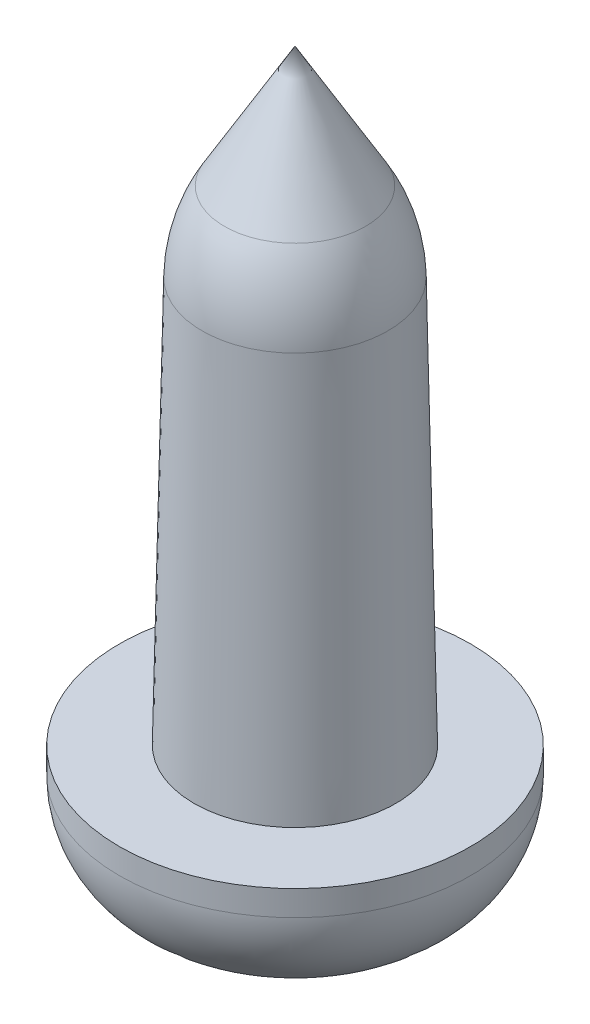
ISO-10303-21;
HEADER;
FILE_DESCRIPTION(('STEP AP214'),'2;1');
FILE_NAME('part.step','',(''),(''),'','','');
FILE_SCHEMA(('AUTOMOTIVE_DESIGN { 1 0 10303 214 1 1 1 1 }'));
ENDSEC;
DATA;
#1=APPLICATION_CONTEXT('core data for automotive mechanical design processes');
#2=APPLICATION_PROTOCOL_DEFINITION('international standard','automotive_design',2000,#1);
#3=PRODUCT_CONTEXT('',#1,'mechanical');
#4=PRODUCT('Part','Part','',(#3));
#5=PRODUCT_RELATED_PRODUCT_CATEGORY('part','',(#4));
#6=PRODUCT_DEFINITION_FORMATION('','',#4);
#7=PRODUCT_DEFINITION_CONTEXT('part definition',#1,'design');
#8=PRODUCT_DEFINITION('design','',#6,#7);
#9=PRODUCT_DEFINITION_SHAPE('','',#8);
#10=(LENGTH_UNIT() NAMED_UNIT(*) SI_UNIT(.MILLI.,.METRE.));
#11=(NAMED_UNIT(*) PLANE_ANGLE_UNIT() SI_UNIT($,.RADIAN.));
#12=(NAMED_UNIT(*) SI_UNIT($,.STERADIAN.) SOLID_ANGLE_UNIT());
#13=UNCERTAINTY_MEASURE_WITH_UNIT(LENGTH_MEASURE(1.E-05),#10,'distance_accuracy_value','');
#14=(GEOMETRIC_REPRESENTATION_CONTEXT(3) GLOBAL_UNCERTAINTY_ASSIGNED_CONTEXT((#13)) GLOBAL_UNIT_ASSIGNED_CONTEXT((#10,
#11,#12)) REPRESENTATION_CONTEXT('',''));
#15=CARTESIAN_POINT('',(0.,0.,0.));
#16=DIRECTION('',(0.,0.,1.));
#17=DIRECTION('',(1.,0.,0.));
#18=AXIS2_PLACEMENT_3D('',#15,#16,#17);
#19=CARTESIAN_POINT('',(0.,4.31540969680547E-06,0.));
#20=DIRECTION('',(0.,-1.,0.));
#21=DIRECTION('',(0.,0.,-1.));
#22=AXIS2_PLACEMENT_3D('',#19,#20,#21);
#23=PLANE('',#22);
#24=DIRECTION('',(-1.,0.,0.));
#25=VECTOR('',#24,1.);
#26=CARTESIAN_POINT('',(0.,4.31540969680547E-06,0.349999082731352));
#27=LINE('',#26,#25);
#28=CARTESIAN_POINT('',(0.652004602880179,1.16357725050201E-06,0.350000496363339));
#29=VERTEX_POINT('',#28);
#30=CARTESIAN_POINT('',(0.55,4.3154096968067E-06,0.349999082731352));
#31=VERTEX_POINT('',#30);
#32=EDGE_CURVE('E104',#29,#31,#27,.T.);
#33=ORIENTED_EDGE('',*,*,#32,.F.);
#34=CARTESIAN_POINT('',(0.,8.63081939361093E-06,0.));
#35=DIRECTION('',(0.,-1.,0.));
#36=DIRECTION('',(0.,0.,-1.));
#37=AXIS2_PLACEMENT_3D('',#34,#35,#36);
#38=CIRCLE('',#37,0.74001166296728);
#39=CARTESIAN_POINT('',(0.349998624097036,6.47311451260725E-06,0.652007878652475));
#40=VERTEX_POINT('',#39);
#41=EDGE_CURVE('E342',#29,#40,#38,.T.);
#42=ORIENTED_EDGE('',*,*,#41,.T.);
#43=DIRECTION('',(0.,0.,1.));
#44=VECTOR('',#43,1.);
#45=CARTESIAN_POINT('',(0.349999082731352,4.31540969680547E-06,0.));
#46=LINE('',#45,#44);
#47=CARTESIAN_POINT('',(0.349999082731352,4.3154096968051E-06,0.55));
#48=VERTEX_POINT('',#47);
#49=EDGE_CURVE('E124',#48,#40,#46,.T.);
#50=ORIENTED_EDGE('',*,*,#49,.F.);
#51=CARTESIAN_POINT('',(0.55,4.31540969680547E-06,0.55));
#52=DIRECTION('',(0.,-1.,0.));
#53=DIRECTION('',(0.,0.,-1.));
#54=AXIS2_PLACEMENT_3D('',#51,#52,#53);
#55=CIRCLE('',#54,0.200000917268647);
#56=EDGE_CURVE('E116',#31,#48,#55,.F.);
#57=ORIENTED_EDGE('',*,*,#56,.F.);
#58=EDGE_LOOP('',(#33,#42,#50,#57));
#59=FACE_BOUND('',#58,.T.);
#60=ADVANCED_FACE('F33',(#59),#23,.T.);
#61=DIRECTION('',(0.,0.,-1.));
#62=VECTOR('',#61,1.);
#63=CARTESIAN_POINT('',(-0.349999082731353,4.31540969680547E-06,0.));
#64=LINE('',#63,#62);
#65=CARTESIAN_POINT('',(-0.35000049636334,1.1635772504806E-06,0.652004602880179));
#66=VERTEX_POINT('',#65);
#67=CARTESIAN_POINT('',(-0.349999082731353,4.31540969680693E-06,0.55));
#68=VERTEX_POINT('',#67);
#69=EDGE_CURVE('E126',#66,#68,#64,.T.);
#70=ORIENTED_EDGE('',*,*,#69,.F.);
#71=CARTESIAN_POINT('',(-0.652007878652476,6.47311451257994E-06,0.349998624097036));
#72=VERTEX_POINT('',#71);
#73=EDGE_CURVE('E345',#66,#72,#38,.T.);
#74=ORIENTED_EDGE('',*,*,#73,.T.);
#75=DIRECTION('',(-1.,0.,0.));
#76=VECTOR('',#75,1.);
#77=CARTESIAN_POINT('',(0.,4.31540969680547E-06,0.349999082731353));
#78=LINE('',#77,#76);
#79=CARTESIAN_POINT('',(-0.55,4.31540969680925E-06,0.349999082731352));
#80=VERTEX_POINT('',#79);
#81=EDGE_CURVE('E135',#80,#72,#78,.T.);
#82=ORIENTED_EDGE('',*,*,#81,.F.);
#83=CARTESIAN_POINT('',(-0.55,4.31540969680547E-06,0.55));
#84=DIRECTION('',(0.,-1.,0.));
#85=DIRECTION('',(0.,0.,-1.));
#86=AXIS2_PLACEMENT_3D('',#83,#84,#85);
#87=CIRCLE('',#86,0.200000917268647);
#88=EDGE_CURVE('E132',#68,#80,#87,.F.);
#89=ORIENTED_EDGE('',*,*,#88,.F.);
#90=EDGE_LOOP('',(#70,#74,#82,#89));
#91=FACE_BOUND('',#90,.T.);
#92=ADVANCED_FACE('F313',(#91),#23,.T.);
#93=DIRECTION('',(1.,0.,0.));
#94=VECTOR('',#93,1.);
#95=CARTESIAN_POINT('',(0.,4.31540969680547E-06,-0.349999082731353));
#96=LINE('',#95,#94);
#97=CARTESIAN_POINT('',(-0.652004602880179,1.16357725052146E-06,-0.350000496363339));
#98=VERTEX_POINT('',#97);
#99=CARTESIAN_POINT('',(-0.55,4.31540969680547E-06,-0.349999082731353));
#100=VERTEX_POINT('',#99);
#101=EDGE_CURVE('E137',#98,#100,#96,.T.);
#102=ORIENTED_EDGE('',*,*,#101,.F.);
#103=CARTESIAN_POINT('',(-0.349998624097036,6.47311451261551E-06,-0.652007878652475));
#104=VERTEX_POINT('',#103);
#105=EDGE_CURVE('E358',#98,#104,#38,.T.);
#106=ORIENTED_EDGE('',*,*,#105,.T.);
#107=DIRECTION('',(0.,0.,-1.));
#108=VECTOR('',#107,1.);
#109=CARTESIAN_POINT('',(-0.349999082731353,4.31540969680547E-06,0.));
#110=LINE('',#109,#108);
#111=CARTESIAN_POINT('',(-0.349999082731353,4.3154096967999E-06,-0.55));
#112=VERTEX_POINT('',#111);
#113=EDGE_CURVE('E144',#112,#104,#110,.T.);
#114=ORIENTED_EDGE('',*,*,#113,.F.);
#115=CARTESIAN_POINT('',(-0.55,4.31540969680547E-06,-0.55));
#116=DIRECTION('',(0.,-1.,0.));
#117=DIRECTION('',(0.,0.,-1.));
#118=AXIS2_PLACEMENT_3D('',#115,#116,#117);
#119=CIRCLE('',#118,0.200000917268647);
#120=EDGE_CURVE('E141',#100,#112,#119,.F.);
#121=ORIENTED_EDGE('',*,*,#120,.F.);
#122=EDGE_LOOP('',(#102,#106,#114,#121));
#123=FACE_BOUND('',#122,.T.);
#124=ADVANCED_FACE('F317',(#123),#23,.T.);
#125=DIRECTION('',(0.,0.,1.));
#126=VECTOR('',#125,1.);
#127=CARTESIAN_POINT('',(0.349999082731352,4.31540969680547E-06,0.));
#128=LINE('',#127,#126);
#129=CARTESIAN_POINT('',(0.350000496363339,1.16357725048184E-06,-0.652004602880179));
#130=VERTEX_POINT('',#129);
#131=CARTESIAN_POINT('',(0.349999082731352,4.31540969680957E-06,-0.55));
#132=VERTEX_POINT('',#131);
#133=EDGE_CURVE('E146',#130,#132,#128,.T.);
#134=ORIENTED_EDGE('',*,*,#133,.F.);
#135=CARTESIAN_POINT('',(0.652007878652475,6.47311451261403E-06,-0.349998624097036));
#136=VERTEX_POINT('',#135);
#137=EDGE_CURVE('E333',#130,#136,#38,.T.);
#138=ORIENTED_EDGE('',*,*,#137,.T.);
#139=DIRECTION('',(1.,0.,0.));
#140=VECTOR('',#139,1.);
#141=CARTESIAN_POINT('',(0.,4.31540969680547E-06,-0.349999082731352));
#142=LINE('',#141,#140);
#143=CARTESIAN_POINT('',(0.55,4.31540969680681E-06,-0.349999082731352));
#144=VERTEX_POINT('',#143);
#145=EDGE_CURVE('E153',#144,#136,#142,.T.);
#146=ORIENTED_EDGE('',*,*,#145,.F.);
#147=CARTESIAN_POINT('',(0.55,4.31540969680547E-06,-0.55));
#148=DIRECTION('',(0.,-1.,0.));
#149=DIRECTION('',(0.,0.,-1.));
#150=AXIS2_PLACEMENT_3D('',#147,#148,#149);
#151=CIRCLE('',#150,0.200000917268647);
#152=EDGE_CURVE('E150',#132,#144,#151,.F.);
#153=ORIENTED_EDGE('',*,*,#152,.F.);
#154=EDGE_LOOP('',(#134,#138,#146,#153));
#155=FACE_BOUND('',#154,.T.);
#156=ADVANCED_FACE('F35',(#155),#23,.T.);
#157=CARTESIAN_POINT('',(0.,1.00000863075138,0.));
#158=DIRECTION('',(0.,-1.,0.));
#159=DIRECTION('',(0.,0.,-1.));
#160=AXIS2_PLACEMENT_3D('',#157,#158,#159);
#161=DEGENERATE_TOROIDAL_SURFACE('',#160,0.739999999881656,1.,.T.);
#162=CARTESIAN_POINT('',(0.26933841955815,0.379482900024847,-1.50020000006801));
#163=CARTESIAN_POINT('',(0.274102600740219,0.357069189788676,-1.48132507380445));
#164=CARTESIAN_POINT('',(0.278695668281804,0.335460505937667,-1.46147507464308));
#165=CARTESIAN_POINT('',(0.287512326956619,0.293981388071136,-1.41996635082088));
#166=CARTESIAN_POINT('',(0.291735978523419,0.274110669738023,-1.39830792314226));
#167=CARTESIAN_POINT('',(0.30376985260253,0.217495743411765,-1.33107012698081));
#168=CARTESIAN_POINT('',(0.310996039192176,0.183499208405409,-1.28301716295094));
#169=CARTESIAN_POINT('',(0.323683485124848,0.123809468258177,-1.18182195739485));
#170=CARTESIAN_POINT('',(0.3291441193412,0.0981192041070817,-1.12867792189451));
#171=CARTESIAN_POINT('',(0.338198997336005,0.0555193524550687,-1.01870742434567));
#172=CARTESIAN_POINT('',(0.341790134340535,0.0386243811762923,-0.961875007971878));
#173=CARTESIAN_POINT('',(0.345749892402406,0.0199951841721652,-0.875059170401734));
#174=CARTESIAN_POINT('',(0.346832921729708,0.0148999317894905,-0.845781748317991));
#175=CARTESIAN_POINT('',(0.348526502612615,0.0069322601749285,-0.786899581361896));
#176=CARTESIAN_POINT('',(0.349136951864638,0.00406032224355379,-0.757294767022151));
#177=CARTESIAN_POINT('',(0.349897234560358,0.000483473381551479,-0.698008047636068));
#178=CARTESIAN_POINT('',(0.35004789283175,-0.000225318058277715,-0.668326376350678));
#179=CARTESIAN_POINT('',(0.349919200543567,0.000380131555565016,-0.609001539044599));
#180=CARTESIAN_POINT('',(0.349640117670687,0.00169311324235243,-0.579358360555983));
#181=CARTESIAN_POINT('',(0.34916036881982,0.00395015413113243,-0.549799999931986));
#182=B_SPLINE_CURVE_WITH_KNOTS('',3,(#162,#163,#164,#165,#166,#167,#168,#169,#170,#171,#172,
#173,#174,#175,#176,#177,#178,#179,#180,#181),.UNSPECIFIED.,.F.,.F.,(4,2,2,2,2,2,2,2,2,4),(0.,
0.0890046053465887,0.177994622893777,0.354994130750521,0.532056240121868,0.709411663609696,
0.798550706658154,0.887709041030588,0.976707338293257,1.06565022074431),.UNSPECIFIED.);
#183=CARTESIAN_POINT('',(0.284428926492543,0.308487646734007,-1.43442892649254));
#184=VERTEX_POINT('',#183);
#185=EDGE_CURVE('E11',#184,#130,#182,.T.);
#186=ORIENTED_EDGE('',*,*,#185,.F.);
#187=CARTESIAN_POINT('',(-0.350200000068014,0.320863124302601,-1.43179843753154));
#188=CARTESIAN_POINT('',(-0.303864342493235,0.311157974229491,-1.43386133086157));
#189=CARTESIAN_POINT('',(-0.257100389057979,0.303497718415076,-1.43548956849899));
#190=CARTESIAN_POINT('',(-0.163042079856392,0.292112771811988,-1.43790951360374));
#191=CARTESIAN_POINT('',(-0.115747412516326,0.288390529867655,-1.43870070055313));
#192=CARTESIAN_POINT('',(-0.0212573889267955,0.284748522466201,-1.43947483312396));
#193=CARTESIAN_POINT('',(0.0259372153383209,0.284809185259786,-1.43946193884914));
#194=CARTESIAN_POINT('',(0.120143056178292,0.288692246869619,-1.4386365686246));
#195=CARTESIAN_POINT('',(0.16715439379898,0.292512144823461,-1.4378246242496));
#196=CARTESIAN_POINT('',(0.236724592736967,0.301085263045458,-1.43600235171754));
#197=CARTESIAN_POINT('',(0.259481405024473,0.304359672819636,-1.43530635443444));
#198=CARTESIAN_POINT('',(0.304927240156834,0.311876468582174,-1.43370861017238));
#199=CARTESIAN_POINT('',(0.327615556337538,0.316122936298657,-1.43280599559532));
#200=CARTESIAN_POINT('',(0.350200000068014,0.3208631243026,-1.43179843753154));
#201=B_SPLINE_CURVE_WITH_KNOTS('',3,(#187,#188,#189,#190,#191,#192,#193,#194,#195,#196,#197,
#198,#199,#200),.UNSPECIFIED.,.F.,.F.,(4,2,2,2,2,2,4),(0.,0.14208299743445,0.284254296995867,
0.425690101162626,0.567031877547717,0.63601873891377,0.705300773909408),.UNSPECIFIED.);
#202=CARTESIAN_POINT('',(-0.284428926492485,0.308487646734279,-1.43442892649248));
#203=VERTEX_POINT('',#202);
#204=EDGE_CURVE('E43',#203,#184,#201,.T.);
#205=ORIENTED_EDGE('',*,*,#204,.F.);
#206=CARTESIAN_POINT('',(-0.34916036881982,0.00395015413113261,-0.549799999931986));
#207=CARTESIAN_POINT('',(-0.349716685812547,0.00133288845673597,-0.583987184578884));
#208=CARTESIAN_POINT('',(-0.350002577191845,-1.2124734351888E-05,-0.618292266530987));
#209=CARTESIAN_POINT('',(-0.349993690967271,2.9681665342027E-05,-0.686928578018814));
#210=CARTESIAN_POINT('',(-0.349698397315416,0.00141892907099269,-0.721259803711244));
#211=CARTESIAN_POINT('',(-0.348484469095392,0.00713001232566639,-0.789774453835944));
#212=CARTESIAN_POINT('',(-0.34756406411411,0.011460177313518,-0.823957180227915));
#213=CARTESIAN_POINT('',(-0.345083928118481,0.023128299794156,-0.891760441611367));
#214=CARTESIAN_POINT('',(-0.343524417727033,0.0304652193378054,-0.925381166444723));
#215=CARTESIAN_POINT('',(-0.337924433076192,0.0568110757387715,-1.02411488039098));
#216=CARTESIAN_POINT('',(-0.332946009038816,0.0802327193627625,-1.08806501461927));
#217=CARTESIAN_POINT('',(-0.320576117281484,0.138428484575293,-1.21009001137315));
#218=CARTESIAN_POINT('',(-0.313192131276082,0.173167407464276,-1.26818236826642));
#219=CARTESIAN_POINT('',(-0.29958334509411,0.237191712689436,-1.35514117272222));
#220=CARTESIAN_POINT('',(-0.294041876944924,0.263262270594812,-1.38652660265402));
#221=CARTESIAN_POINT('',(-0.282223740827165,0.318862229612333,-1.44597253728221));
#222=CARTESIAN_POINT('',(-0.275946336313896,0.348395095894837,-1.47402965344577));
#223=CARTESIAN_POINT('',(-0.26933841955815,0.379482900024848,-1.50020000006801));
#224=B_SPLINE_CURVE_WITH_KNOTS('',3,(#206,#207,#208,#209,#210,#211,#212,#213,#214,#215,#216,
#217,#218,#219,#220,#221,#222,#223),.UNSPECIFIED.,.F.,.F.,(4,2,2,2,2,2,2,2,4),(0.,
0.10287413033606,0.205839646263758,0.309097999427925,0.412320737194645,0.615903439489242,
0.818858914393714,0.942120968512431,1.06550745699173),.UNSPECIFIED.);
#225=EDGE_CURVE('E294',#104,#203,#224,.T.);
#226=ORIENTED_EDGE('',*,*,#225,.F.);
#227=ORIENTED_EDGE('',*,*,#105,.F.);
#228=CARTESIAN_POINT('',(-1.50020000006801,0.379482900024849,-0.269338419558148));
#229=CARTESIAN_POINT('',(-1.48132507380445,0.357069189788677,-0.274102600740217));
#230=CARTESIAN_POINT('',(-1.46147507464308,0.335460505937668,-0.278695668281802));
#231=CARTESIAN_POINT('',(-1.41996635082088,0.293981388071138,-0.287512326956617));
#232=CARTESIAN_POINT('',(-1.39830792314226,0.274110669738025,-0.291735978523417));
#233=CARTESIAN_POINT('',(-1.33107012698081,0.217495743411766,-0.303769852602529));
#234=CARTESIAN_POINT('',(-1.28301716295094,0.18349920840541,-0.310996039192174));
#235=CARTESIAN_POINT('',(-1.18182195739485,0.123809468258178,-0.323683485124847));
#236=CARTESIAN_POINT('',(-1.12867792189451,0.0981192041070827,-0.329144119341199));
#237=CARTESIAN_POINT('',(-1.01870742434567,0.0555193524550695,-0.338198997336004));
#238=CARTESIAN_POINT('',(-0.96187500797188,0.0386243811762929,-0.341790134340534));
#239=CARTESIAN_POINT('',(-0.875059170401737,0.0199951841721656,-0.345749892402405));
#240=CARTESIAN_POINT('',(-0.845781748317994,0.0148999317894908,-0.346832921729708));
#241=CARTESIAN_POINT('',(-0.786899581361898,0.00693226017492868,-0.348526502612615));
#242=CARTESIAN_POINT('',(-0.757294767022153,0.00406032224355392,-0.349136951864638));
#243=CARTESIAN_POINT('',(-0.698008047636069,0.000483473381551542,-0.349897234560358));
#244=CARTESIAN_POINT('',(-0.66832637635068,-0.000225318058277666,-0.350047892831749));
#245=CARTESIAN_POINT('',(-0.6090015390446,0.000380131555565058,-0.349919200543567));
#246=CARTESIAN_POINT('',(-0.579358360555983,0.00169311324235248,-0.349640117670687));
#247=CARTESIAN_POINT('',(-0.549799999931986,0.00395015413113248,-0.34916036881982));
#248=B_SPLINE_CURVE_WITH_KNOTS('',3,(#228,#229,#230,#231,#232,#233,#234,#235,#236,#237,#238,
#239,#240,#241,#242,#243,#244,#245,#246,#247),.UNSPECIFIED.,.F.,.F.,(4,2,2,2,2,2,2,2,2,4),(0.,
0.0890046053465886,0.177994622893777,0.354994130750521,0.532056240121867,0.709411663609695,
0.798550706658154,0.887709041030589,0.976707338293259,1.06565022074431),.UNSPECIFIED.);
#249=CARTESIAN_POINT('',(-1.43442892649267,0.308487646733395,-0.284428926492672));
#250=VERTEX_POINT('',#249);
#251=EDGE_CURVE('E293',#250,#98,#248,.T.);
#252=ORIENTED_EDGE('',*,*,#251,.F.);
#253=CARTESIAN_POINT('',(-1.43179843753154,0.320863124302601,0.350200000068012));
#254=CARTESIAN_POINT('',(-1.43386133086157,0.311157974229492,0.303864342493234));
#255=CARTESIAN_POINT('',(-1.435489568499,0.303497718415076,0.257100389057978));
#256=CARTESIAN_POINT('',(-1.43790951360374,0.292112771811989,0.163042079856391));
#257=CARTESIAN_POINT('',(-1.43870070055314,0.288390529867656,0.115747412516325));
#258=CARTESIAN_POINT('',(-1.43947483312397,0.284748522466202,0.021257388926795));
#259=CARTESIAN_POINT('',(-1.43946193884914,0.284809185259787,-0.0259372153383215));
#260=CARTESIAN_POINT('',(-1.4386365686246,0.28869224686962,-0.120143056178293));
#261=CARTESIAN_POINT('',(-1.4378246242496,0.292512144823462,-0.16715439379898));
#262=CARTESIAN_POINT('',(-1.43600235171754,0.301085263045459,-0.236724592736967));
#263=CARTESIAN_POINT('',(-1.43530635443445,0.304359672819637,-0.259481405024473));
#264=CARTESIAN_POINT('',(-1.43370861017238,0.311876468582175,-0.304927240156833));
#265=CARTESIAN_POINT('',(-1.43280599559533,0.316122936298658,-0.327615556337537));
#266=CARTESIAN_POINT('',(-1.43179843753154,0.320863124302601,-0.350200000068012));
#267=B_SPLINE_CURVE_WITH_KNOTS('',3,(#253,#254,#255,#256,#257,#258,#259,#260,#261,#262,#263,
#264,#265,#266),.UNSPECIFIED.,.F.,.F.,(4,2,2,2,2,2,4),(0.,0.142082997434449,0.284254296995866,
0.425690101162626,0.567031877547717,0.636018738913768,0.705300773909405),.UNSPECIFIED.);
#268=CARTESIAN_POINT('',(-1.43442892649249,0.308487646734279,0.284428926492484));
#269=VERTEX_POINT('',#268);
#270=EDGE_CURVE('E266',#269,#250,#267,.T.);
#271=ORIENTED_EDGE('',*,*,#270,.F.);
#272=CARTESIAN_POINT('',(-0.549799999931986,0.00395015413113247,0.34916036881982));
#273=CARTESIAN_POINT('',(-0.583987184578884,0.0013328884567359,0.349716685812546));
#274=CARTESIAN_POINT('',(-0.618292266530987,-1.21247343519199E-05,0.350002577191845));
#275=CARTESIAN_POINT('',(-0.686928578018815,2.96816653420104E-05,0.34999369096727));
#276=CARTESIAN_POINT('',(-0.721259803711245,0.00141892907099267,0.349698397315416));
#277=CARTESIAN_POINT('',(-0.789774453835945,0.00713001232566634,0.348484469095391));
#278=CARTESIAN_POINT('',(-0.823957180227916,0.0114601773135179,0.347564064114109));
#279=CARTESIAN_POINT('',(-0.891760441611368,0.0231282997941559,0.34508392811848));
#280=CARTESIAN_POINT('',(-0.925381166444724,0.0304652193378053,0.343524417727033));
#281=CARTESIAN_POINT('',(-1.02411488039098,0.0568110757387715,0.337924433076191));
#282=CARTESIAN_POINT('',(-1.08806501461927,0.0802327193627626,0.332946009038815));
#283=CARTESIAN_POINT('',(-1.21009001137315,0.138428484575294,0.320576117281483));
#284=CARTESIAN_POINT('',(-1.26818236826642,0.173167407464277,0.313192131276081));
#285=CARTESIAN_POINT('',(-1.35514117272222,0.237191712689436,0.299583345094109));
#286=CARTESIAN_POINT('',(-1.38652660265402,0.263262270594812,0.294041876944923));
#287=CARTESIAN_POINT('',(-1.44597253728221,0.318862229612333,0.282223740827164));
#288=CARTESIAN_POINT('',(-1.47402965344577,0.348395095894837,0.275946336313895));
#289=CARTESIAN_POINT('',(-1.50020000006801,0.379482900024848,0.269338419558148));
#290=B_SPLINE_CURVE_WITH_KNOTS('',3,(#272,#273,#274,#275,#276,#277,#278,#279,#280,#281,#282,
#283,#284,#285,#286,#287,#288,#289),.UNSPECIFIED.,.F.,.F.,(4,2,2,2,2,2,2,2,4),(0.,
0.10287413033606,0.205839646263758,0.309097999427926,0.412320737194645,0.615903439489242,
0.818858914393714,0.942120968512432,1.06550745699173),.UNSPECIFIED.);
#291=EDGE_CURVE('E260',#72,#269,#290,.T.);
#292=ORIENTED_EDGE('',*,*,#291,.F.);
#293=ORIENTED_EDGE('',*,*,#73,.F.);
#294=CARTESIAN_POINT('',(-0.26933841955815,0.379482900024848,1.50020000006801));
#295=CARTESIAN_POINT('',(-0.274102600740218,0.357069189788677,1.48132507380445));
#296=CARTESIAN_POINT('',(-0.278695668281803,0.335460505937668,1.46147507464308));
#297=CARTESIAN_POINT('',(-0.287512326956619,0.293981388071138,1.41996635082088));
#298=CARTESIAN_POINT('',(-0.291735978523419,0.274110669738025,1.39830792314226));
#299=CARTESIAN_POINT('',(-0.30376985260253,0.217495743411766,1.33107012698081));
#300=CARTESIAN_POINT('',(-0.310996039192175,0.18349920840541,1.28301716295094));
#301=CARTESIAN_POINT('',(-0.323683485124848,0.123809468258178,1.18182195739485));
#302=CARTESIAN_POINT('',(-0.3291441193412,0.0981192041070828,1.12867792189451));
#303=CARTESIAN_POINT('',(-0.338198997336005,0.0555193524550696,1.01870742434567));
#304=CARTESIAN_POINT('',(-0.341790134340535,0.0386243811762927,0.96187500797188));
#305=CARTESIAN_POINT('',(-0.345749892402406,0.0199951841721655,0.875059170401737));
#306=CARTESIAN_POINT('',(-0.346832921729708,0.0148999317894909,0.845781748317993));
#307=CARTESIAN_POINT('',(-0.348526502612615,0.00693226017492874,0.786899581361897));
#308=CARTESIAN_POINT('',(-0.349136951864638,0.00406032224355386,0.757294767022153));
#309=CARTESIAN_POINT('',(-0.349897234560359,0.000483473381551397,0.698008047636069));
#310=CARTESIAN_POINT('',(-0.35004789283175,-0.000225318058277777,0.668326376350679));
#311=CARTESIAN_POINT('',(-0.349919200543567,0.000380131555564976,0.6090015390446));
#312=CARTESIAN_POINT('',(-0.349640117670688,0.00169311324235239,0.579358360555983));
#313=CARTESIAN_POINT('',(-0.34916036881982,0.00395015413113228,0.549799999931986));
#314=B_SPLINE_CURVE_WITH_KNOTS('',3,(#294,#295,#296,#297,#298,#299,#300,#301,#302,#303,#304,
#305,#306,#307,#308,#309,#310,#311,#312,#313),.UNSPECIFIED.,.F.,.F.,(4,2,2,2,2,2,2,2,2,4),(0.,
0.0890046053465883,0.177994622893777,0.354994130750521,0.532056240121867,0.709411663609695,
0.798550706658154,0.887709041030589,0.976707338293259,1.06565022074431),.UNSPECIFIED.);
#315=CARTESIAN_POINT('',(-0.284428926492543,0.308487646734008,1.43442892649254));
#316=VERTEX_POINT('',#315);
#317=EDGE_CURVE('E259',#316,#66,#314,.T.);
#318=ORIENTED_EDGE('',*,*,#317,.F.);
#319=CARTESIAN_POINT('',(0.350200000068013,0.3208631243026,1.43179843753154));
#320=CARTESIAN_POINT('',(0.303864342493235,0.311157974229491,1.43386133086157));
#321=CARTESIAN_POINT('',(0.257100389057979,0.303497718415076,1.43548956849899));
#322=CARTESIAN_POINT('',(0.163042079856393,0.292112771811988,1.43790951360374));
#323=CARTESIAN_POINT('',(0.115747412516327,0.288390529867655,1.43870070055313));
#324=CARTESIAN_POINT('',(0.0212573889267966,0.284748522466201,1.43947483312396));
#325=CARTESIAN_POINT('',(-0.0259372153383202,0.284809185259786,1.43946193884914));
#326=CARTESIAN_POINT('',(-0.120143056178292,0.288692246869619,1.4386365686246));
#327=CARTESIAN_POINT('',(-0.16715439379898,0.292512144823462,1.4378246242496));
#328=CARTESIAN_POINT('',(-0.236724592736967,0.301085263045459,1.43600235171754));
#329=CARTESIAN_POINT('',(-0.259481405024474,0.304359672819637,1.43530635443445));
#330=CARTESIAN_POINT('',(-0.304927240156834,0.311876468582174,1.43370861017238));
#331=CARTESIAN_POINT('',(-0.327615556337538,0.316122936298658,1.43280599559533));
#332=CARTESIAN_POINT('',(-0.350200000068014,0.320863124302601,1.43179843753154));
#333=B_SPLINE_CURVE_WITH_KNOTS('',3,(#319,#320,#321,#322,#323,#324,#325,#326,#327,#328,#329,
#330,#331,#332),.UNSPECIFIED.,.F.,.F.,(4,2,2,2,2,2,4),(0.,0.142082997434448,0.284254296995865,
0.425690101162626,0.567031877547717,0.636018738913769,0.705300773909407),.UNSPECIFIED.);
#334=CARTESIAN_POINT('',(0.284428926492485,0.308487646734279,1.43442892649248));
#335=VERTEX_POINT('',#334);
#336=EDGE_CURVE('E230',#335,#316,#333,.T.);
#337=ORIENTED_EDGE('',*,*,#336,.F.);
#338=CARTESIAN_POINT('',(0.349160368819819,0.00395015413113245,0.549799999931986));
#339=CARTESIAN_POINT('',(0.349716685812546,0.00133288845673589,0.583987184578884));
#340=CARTESIAN_POINT('',(0.350002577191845,-1.21247343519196E-05,0.618292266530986));
#341=CARTESIAN_POINT('',(0.34999369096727,2.96816653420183E-05,0.686928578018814));
#342=CARTESIAN_POINT('',(0.349698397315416,0.00141892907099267,0.721259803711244));
#343=CARTESIAN_POINT('',(0.348484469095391,0.00713001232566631,0.789774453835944));
#344=CARTESIAN_POINT('',(0.347564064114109,0.0114601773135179,0.823957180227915));
#345=CARTESIAN_POINT('',(0.34508392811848,0.0231282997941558,0.891760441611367));
#346=CARTESIAN_POINT('',(0.343524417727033,0.0304652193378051,0.925381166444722));
#347=CARTESIAN_POINT('',(0.337924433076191,0.0568110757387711,1.02411488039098));
#348=CARTESIAN_POINT('',(0.332946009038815,0.080232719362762,1.08806501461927));
#349=CARTESIAN_POINT('',(0.320576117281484,0.138428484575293,1.21009001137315));
#350=CARTESIAN_POINT('',(0.313192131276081,0.173167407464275,1.26818236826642));
#351=CARTESIAN_POINT('',(0.299583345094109,0.237191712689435,1.35514117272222));
#352=CARTESIAN_POINT('',(0.294041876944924,0.263262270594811,1.38652660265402));
#353=CARTESIAN_POINT('',(0.282223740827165,0.318862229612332,1.44597253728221));
#354=CARTESIAN_POINT('',(0.275946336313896,0.348395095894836,1.47402965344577));
#355=CARTESIAN_POINT('',(0.269338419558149,0.379482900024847,1.50020000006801));
#356=B_SPLINE_CURVE_WITH_KNOTS('',3,(#338,#339,#340,#341,#342,#343,#344,#345,#346,#347,#348,
#349,#350,#351,#352,#353,#354,#355),.UNSPECIFIED.,.F.,.F.,(4,2,2,2,2,2,2,2,4),(0.,
0.10287413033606,0.205839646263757,0.309097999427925,0.412320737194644,0.615903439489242,
0.818858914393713,0.94212096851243,1.06550745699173),.UNSPECIFIED.);
#357=EDGE_CURVE('E217',#40,#335,#356,.T.);
#358=ORIENTED_EDGE('',*,*,#357,.F.);
#359=ORIENTED_EDGE('',*,*,#41,.F.);
#360=CARTESIAN_POINT('',(1.50020000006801,0.379482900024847,0.26933841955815));
#361=CARTESIAN_POINT('',(1.48132507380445,0.357069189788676,0.274102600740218));
#362=CARTESIAN_POINT('',(1.46147507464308,0.335460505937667,0.278695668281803));
#363=CARTESIAN_POINT('',(1.41996635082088,0.293981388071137,0.287512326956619));
#364=CARTESIAN_POINT('',(1.39830792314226,0.274110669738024,0.291735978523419));
#365=CARTESIAN_POINT('',(1.33107012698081,0.217495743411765,0.30376985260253));
#366=CARTESIAN_POINT('',(1.28301716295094,0.183499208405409,0.310996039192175));
#367=CARTESIAN_POINT('',(1.18182195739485,0.123809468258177,0.323683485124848));
#368=CARTESIAN_POINT('',(1.12867792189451,0.098119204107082,0.329144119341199));
#369=CARTESIAN_POINT('',(1.01870742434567,0.0555193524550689,0.338198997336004));
#370=CARTESIAN_POINT('',(0.961875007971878,0.0386243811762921,0.341790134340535));
#371=CARTESIAN_POINT('',(0.875059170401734,0.0199951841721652,0.345749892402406));
#372=CARTESIAN_POINT('',(0.845781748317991,0.0148999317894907,0.346832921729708));
#373=CARTESIAN_POINT('',(0.786899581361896,0.00693226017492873,0.348526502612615));
#374=CARTESIAN_POINT('',(0.757294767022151,0.00406032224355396,0.349136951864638));
#375=CARTESIAN_POINT('',(0.698008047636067,0.000483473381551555,0.349897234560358));
#376=CARTESIAN_POINT('',(0.668326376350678,-0.000225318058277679,0.35004789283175));
#377=CARTESIAN_POINT('',(0.609001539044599,0.00038013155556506,0.349919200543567));
#378=CARTESIAN_POINT('',(0.579358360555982,0.00169311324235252,0.349640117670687));
#379=CARTESIAN_POINT('',(0.549799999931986,0.00395015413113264,0.34916036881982));
#380=B_SPLINE_CURVE_WITH_KNOTS('',3,(#360,#361,#362,#363,#364,#365,#366,#367,#368,#369,#370,
#371,#372,#373,#374,#375,#376,#377,#378,#379),.UNSPECIFIED.,.F.,.F.,(4,2,2,2,2,2,2,2,2,4),(0.,
0.0890046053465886,0.177994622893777,0.354994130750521,0.532056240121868,0.709411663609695,
0.798550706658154,0.887709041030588,0.976707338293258,1.06565022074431),.UNSPECIFIED.);
#381=CARTESIAN_POINT('',(1.43442892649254,0.308487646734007,0.284428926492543));
#382=VERTEX_POINT('',#381);
#383=EDGE_CURVE('E111',#382,#29,#380,.T.);
#384=ORIENTED_EDGE('',*,*,#383,.F.);
#385=CARTESIAN_POINT('',(1.43179843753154,0.3208631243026,-0.350200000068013));
#386=CARTESIAN_POINT('',(1.43386133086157,0.311157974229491,-0.303864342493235));
#387=CARTESIAN_POINT('',(1.43548956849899,0.303497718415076,-0.257100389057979));
#388=CARTESIAN_POINT('',(1.43790951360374,0.292112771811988,-0.163042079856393));
#389=CARTESIAN_POINT('',(1.43870070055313,0.288390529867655,-0.115747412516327));
#390=CARTESIAN_POINT('',(1.43947483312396,0.284748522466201,-0.0212573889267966));
#391=CARTESIAN_POINT('',(1.43946193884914,0.284809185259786,0.0259372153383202));
#392=CARTESIAN_POINT('',(1.4386365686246,0.288692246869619,0.120143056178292));
#393=CARTESIAN_POINT('',(1.4378246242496,0.292512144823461,0.16715439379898));
#394=CARTESIAN_POINT('',(1.43600235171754,0.301085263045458,0.236724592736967));
#395=CARTESIAN_POINT('',(1.43530635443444,0.304359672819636,0.259481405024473));
#396=CARTESIAN_POINT('',(1.43370861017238,0.311876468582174,0.304927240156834));
#397=CARTESIAN_POINT('',(1.43280599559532,0.316122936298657,0.327615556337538));
#398=CARTESIAN_POINT('',(1.43179843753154,0.3208631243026,0.350200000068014));
#399=B_SPLINE_CURVE_WITH_KNOTS('',3,(#385,#386,#387,#388,#389,#390,#391,#392,#393,#394,#395,
#396,#397,#398),.UNSPECIFIED.,.F.,.F.,(4,2,2,2,2,2,4),(0.,0.142082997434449,0.284254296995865,
0.425690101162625,0.567031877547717,0.636018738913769,0.705300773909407),.UNSPECIFIED.);
#400=CARTESIAN_POINT('',(1.43442892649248,0.308487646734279,-0.284428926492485));
#401=VERTEX_POINT('',#400);
#402=EDGE_CURVE('E218',#401,#382,#399,.T.);
#403=ORIENTED_EDGE('',*,*,#402,.F.);
#404=CARTESIAN_POINT('',(0.549799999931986,0.00395015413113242,-0.34916036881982));
#405=CARTESIAN_POINT('',(0.583987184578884,0.00133288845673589,-0.349716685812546));
#406=CARTESIAN_POINT('',(0.618292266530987,-1.21247343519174E-05,-0.350002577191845));
#407=CARTESIAN_POINT('',(0.686928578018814,2.96816653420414E-05,-0.34999369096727));
#408=CARTESIAN_POINT('',(0.721259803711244,0.0014189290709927,-0.349698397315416));
#409=CARTESIAN_POINT('',(0.789774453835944,0.00713001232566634,-0.348484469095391));
#410=CARTESIAN_POINT('',(0.823957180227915,0.0114601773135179,-0.34756406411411));
#411=CARTESIAN_POINT('',(0.891760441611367,0.0231282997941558,-0.34508392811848));
#412=CARTESIAN_POINT('',(0.925381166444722,0.0304652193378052,-0.343524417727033));
#413=CARTESIAN_POINT('',(1.02411488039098,0.0568110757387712,-0.337924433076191));
#414=CARTESIAN_POINT('',(1.08806501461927,0.0802327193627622,-0.332946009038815));
#415=CARTESIAN_POINT('',(1.21009001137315,0.138428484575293,-0.320576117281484));
#416=CARTESIAN_POINT('',(1.26818236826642,0.173167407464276,-0.313192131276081));
#417=CARTESIAN_POINT('',(1.35514117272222,0.237191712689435,-0.299583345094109));
#418=CARTESIAN_POINT('',(1.38652660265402,0.263262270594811,-0.294041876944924));
#419=CARTESIAN_POINT('',(1.44597253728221,0.318862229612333,-0.282223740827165));
#420=CARTESIAN_POINT('',(1.47402965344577,0.348395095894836,-0.275946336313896));
#421=CARTESIAN_POINT('',(1.50020000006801,0.379482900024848,-0.269338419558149));
#422=B_SPLINE_CURVE_WITH_KNOTS('',3,(#404,#405,#406,#407,#408,#409,#410,#411,#412,#413,#414,
#415,#416,#417,#418,#419,#420,#421),.UNSPECIFIED.,.F.,.F.,(4,2,2,2,2,2,2,2,4),(0.,
0.10287413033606,0.205839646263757,0.309097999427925,0.412320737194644,0.615903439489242,
0.818858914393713,0.942120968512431,1.06550745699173),.UNSPECIFIED.);
#423=EDGE_CURVE('E210',#136,#401,#422,.T.);
#424=ORIENTED_EDGE('',*,*,#423,.F.);
#425=ORIENTED_EDGE('',*,*,#137,.F.);
#426=EDGE_LOOP('',(#186,#205,#226,#227,#252,#271,#292,#293,#318,#337,#358,#359,#384,#403,#424,#425));
#427=FACE_BOUND('',#426,.T.);
#428=CARTESIAN_POINT('',(0.,1.00000863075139,0.));
#429=DIRECTION('',(0.,-1.,0.));
#430=DIRECTION('',(0.,0.,-1.));
#431=AXIS2_PLACEMENT_3D('',#428,#429,#430);
#432=CIRCLE('',#431,1.73999999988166);
#433=CARTESIAN_POINT('',(0.,1.00000863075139,-1.73999999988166));
#434=VERTEX_POINT('',#433);
#435=EDGE_CURVE('E349',#434,#434,#432,.T.);
#436=ORIENTED_EDGE('',*,*,#435,.T.);
#437=EDGE_LOOP('',(#436));
#438=FACE_BOUND('',#437,.T.);
#439=ADVANCED_FACE('F185',(#427,#438),#161,.T.);
#440=CARTESIAN_POINT('',(0.,0.,0.));
#441=DIRECTION('',(0.,-1.,0.));
#442=DIRECTION('',(0.,0.,-1.));
#443=AXIS2_PLACEMENT_3D('',#440,#441,#442);
#444=CYLINDRICAL_SURFACE('',#443,1.73999999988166);
#445=CARTESIAN_POINT('',(0.,1.25,0.));
#446=DIRECTION('',(0.,-1.,0.));
#447=DIRECTION('',(0.,0.,-1.));
#448=AXIS2_PLACEMENT_3D('',#445,#446,#447);
#449=CIRCLE('',#448,1.73999999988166);
#450=CARTESIAN_POINT('',(0.,1.25,-1.73999999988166));
#451=VERTEX_POINT('',#450);
#452=EDGE_CURVE('E435',#451,#451,#449,.T.);
#453=ORIENTED_EDGE('',*,*,#452,.T.);
#454=EDGE_LOOP('',(#453));
#455=FACE_BOUND('',#454,.T.);
#456=ORIENTED_EDGE('',*,*,#435,.F.);
#457=EDGE_LOOP('',(#456));
#458=FACE_BOUND('',#457,.T.);
#459=ADVANCED_FACE('F325',(#455,#458),#444,.T.);
#460=CARTESIAN_POINT('',(1.73999999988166,1.25,0.));
#461=DIRECTION('',(0.,1.,0.));
#462=DIRECTION('',(0.,0.,1.));
#463=AXIS2_PLACEMENT_3D('',#460,#461,#462);
#464=PLANE('',#463);
#465=CARTESIAN_POINT('',(0.,1.25,0.));
#466=DIRECTION('',(0.,-1.,0.));
#467=DIRECTION('',(0.,0.,-1.));
#468=AXIS2_PLACEMENT_3D('',#465,#466,#467);
#469=CIRCLE('',#468,1.);
#470=CARTESIAN_POINT('',(0.,1.25,-1.));
#471=VERTEX_POINT('',#470);
#472=EDGE_CURVE('E433',#471,#471,#469,.T.);
#473=ORIENTED_EDGE('',*,*,#472,.T.);
#474=EDGE_LOOP('',(#473));
#475=FACE_BOUND('',#474,.T.);
#476=ORIENTED_EDGE('',*,*,#452,.F.);
#477=EDGE_LOOP('',(#476));
#478=FACE_BOUND('',#477,.T.);
#479=ADVANCED_FACE('F443',(#475,#478),#464,.T.);
#480=CARTESIAN_POINT('',(0.,1.25,0.));
#481=DIRECTION('',(0.,-1.,0.));
#482=DIRECTION('',(0.,0.,-1.));
#483=AXIS2_PLACEMENT_3D('',#480,#481,#482);
#484=CONICAL_SURFACE('',#483,1.,0.0198740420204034);
#485=CARTESIAN_POINT('',(0.,5.26494192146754,0.));
#486=DIRECTION('',(0.,-1.,0.));
#487=DIRECTION('',(0.,0.,-1.));
#488=AXIS2_PLACEMENT_3D('',#485,#486,#487);
#489=CIRCLE('',#488,0.920196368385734);
#490=CARTESIAN_POINT('',(0.,5.26494192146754,-0.920196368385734));
#491=VERTEX_POINT('',#490);
#492=EDGE_CURVE('E430',#491,#491,#489,.T.);
#493=ORIENTED_EDGE('',*,*,#492,.T.);
#494=EDGE_LOOP('',(#493));
#495=FACE_BOUND('',#494,.T.);
#496=ORIENTED_EDGE('',*,*,#472,.F.);
#497=EDGE_LOOP('',(#496));
#498=FACE_BOUND('',#497,.T.);
#499=ADVANCED_FACE('F447',(#495,#498),#484,.T.);
#500=CARTESIAN_POINT('',(0.,5.2326483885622,0.));
#501=DIRECTION('',(0.,-1.,0.));
#502=DIRECTION('',(0.,0.,-1.));
#503=AXIS2_PLACEMENT_3D('',#500,#501,#502);
#504=DEGENERATE_TOROIDAL_SURFACE('',#503,0.704499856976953,1.62501713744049,.F.);
#505=CARTESIAN_POINT('',(0.,6.05144744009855,0.));
#506=DIRECTION('',(0.,-1.,0.));
#507=DIRECTION('',(0.,0.,-1.));
#508=AXIS2_PLACEMENT_3D('',#505,#506,#507);
#509=CIRCLE('',#508,0.699155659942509);
#510=CARTESIAN_POINT('',(0.,6.05144744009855,-0.699155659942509));
#511=VERTEX_POINT('',#510);
#512=EDGE_CURVE('E427',#511,#511,#509,.T.);
#513=ORIENTED_EDGE('',*,*,#512,.T.);
#514=EDGE_LOOP('',(#513));
#515=FACE_BOUND('',#514,.T.);
#516=ORIENTED_EDGE('',*,*,#492,.F.);
#517=EDGE_LOOP('',(#516));
#518=FACE_BOUND('',#517,.T.);
#519=ADVANCED_FACE('F452',(#515,#518),#504,.F.);
#520=CARTESIAN_POINT('',(0.,6.05144744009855,0.));
#521=DIRECTION('',(0.,-1.,0.));
#522=DIRECTION('',(0.,0.,-1.));
#523=AXIS2_PLACEMENT_3D('',#520,#521,#522);
#524=CONICAL_SURFACE('',#523,0.699155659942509,0.528074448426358);
#525=CARTESIAN_POINT('',(0.,7.25,0.));
#526=VERTEX_POINT('',#525);
#527=VERTEX_LOOP('',#526);
#528=FACE_BOUND('',#527,.T.);
#529=ORIENTED_EDGE('',*,*,#512,.F.);
#530=EDGE_LOOP('',(#529));
#531=FACE_BOUND('',#530,.T.);
#532=ADVANCED_FACE('F207',(#528,#531),#524,.T.);
#533=CARTESIAN_POINT('',(1.5,0.,0.35));
#534=DIRECTION('',(0.978147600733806,0.20791169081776,0.));
#535=DIRECTION('',(-0.20791169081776,0.978147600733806,0.));
#536=AXIS2_PLACEMENT_3D('',#533,#534,#535);
#537=PLANE('',#536);
#538=ORIENTED_EDGE('',*,*,#402,.T.);
#539=DIRECTION('',(0.203558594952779,-0.957667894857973,0.203558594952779));
#540=VECTOR('',#539,1.);
#541=CARTESIAN_POINT('',(1.5,0.,0.35));
#542=LINE('',#541,#540);
#543=CARTESIAN_POINT('',(1.28744343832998,1.,0.137443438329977));
#544=VERTEX_POINT('',#543);
#545=EDGE_CURVE('E52',#544,#382,#542,.T.);
#546=ORIENTED_EDGE('',*,*,#545,.F.);
#547=DIRECTION('',(0.,0.,1.));
#548=VECTOR('',#547,1.);
#549=CARTESIAN_POINT('',(1.28744343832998,1.,-0.549999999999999));
#550=LINE('',#549,#548);
#551=CARTESIAN_POINT('',(1.28744343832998,1.,-0.137443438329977));
#552=VERTEX_POINT('',#551);
#553=EDGE_CURVE('E155',#552,#544,#550,.T.);
#554=ORIENTED_EDGE('',*,*,#553,.F.);
#555=DIRECTION('',(0.20355859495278,-0.957667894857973,-0.203558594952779));
#556=VECTOR('',#555,1.);
#557=CARTESIAN_POINT('',(1.5,0.,-0.35));
#558=LINE('',#557,#556);
#559=EDGE_CURVE('E158',#552,#401,#558,.T.);
#560=ORIENTED_EDGE('',*,*,#559,.T.);
#561=EDGE_LOOP('',(#538,#546,#554,#560));
#562=FACE_BOUND('',#561,.T.);
#563=ADVANCED_FACE('F205',(#562),#537,.F.);
#564=CARTESIAN_POINT('',(1.5,0.,-0.35));
#565=DIRECTION('',(0.,0.20791169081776,-0.978147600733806));
#566=DIRECTION('',(0.,0.978147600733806,0.20791169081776));
#567=AXIS2_PLACEMENT_3D('',#564,#565,#566);
#568=PLANE('',#567);
#569=ORIENTED_EDGE('',*,*,#423,.T.);
#570=ORIENTED_EDGE('',*,*,#559,.F.);
#571=DIRECTION('',(1.,0.,0.));
#572=VECTOR('',#571,1.);
#573=CARTESIAN_POINT('',(0.55,1.,-0.137443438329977));
#574=LINE('',#573,#572);
#575=CARTESIAN_POINT('',(0.55,1.,-0.137443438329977));
#576=VERTEX_POINT('',#575);
#577=EDGE_CURVE('E382',#576,#552,#574,.T.);
#578=ORIENTED_EDGE('',*,*,#577,.F.);
#579=DIRECTION('',(0.,-0.978147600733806,-0.20791169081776));
#580=VECTOR('',#579,1.);
#581=CARTESIAN_POINT('',(0.55,0.,-0.35));
#582=LINE('',#581,#580);
#583=EDGE_CURVE('E156',#576,#144,#582,.T.);
#584=ORIENTED_EDGE('',*,*,#583,.T.);
#585=ORIENTED_EDGE('',*,*,#145,.T.);
#586=EDGE_LOOP('',(#569,#570,#578,#584,#585));
#587=FACE_BOUND('',#586,.T.);
#588=ADVANCED_FACE('F200',(#587),#568,.F.);
#589=CARTESIAN_POINT('',(0.55,0.,-0.55));
#590=DIRECTION('',(0.,1.,0.));
#591=DIRECTION('',(0.,0.,-1.));
#592=AXIS2_PLACEMENT_3D('',#589,#590,#591);
#593=CONICAL_SURFACE('',#592,0.2,0.20943951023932);
#594=ORIENTED_EDGE('',*,*,#152,.T.);
#595=ORIENTED_EDGE('',*,*,#583,.F.);
#596=CARTESIAN_POINT('',(0.55,1.,-0.55));
#597=DIRECTION('',(0.,-1.,0.));
#598=DIRECTION('',(0.,0.,-1.));
#599=AXIS2_PLACEMENT_3D('',#596,#597,#598);
#600=CIRCLE('',#599,0.412556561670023);
#601=CARTESIAN_POINT('',(0.137443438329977,1.,-0.55));
#602=VERTEX_POINT('',#601);
#603=EDGE_CURVE('E391',#602,#576,#600,.F.);
#604=ORIENTED_EDGE('',*,*,#603,.F.);
#605=DIRECTION('',(0.20791169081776,-0.978147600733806,0.));
#606=VECTOR('',#605,1.);
#607=CARTESIAN_POINT('',(0.35,0.,-0.55));
#608=LINE('',#607,#606);
#609=EDGE_CURVE('E159',#602,#132,#608,.T.);
#610=ORIENTED_EDGE('',*,*,#609,.T.);
#611=EDGE_LOOP('',(#594,#595,#604,#610));
#612=FACE_BOUND('',#611,.T.);
#613=ADVANCED_FACE('F194',(#612),#593,.T.);
#614=CARTESIAN_POINT('',(0.350000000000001,0.,-1.5));
#615=DIRECTION('',(0.978147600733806,0.20791169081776,0.));
#616=DIRECTION('',(-0.20791169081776,0.978147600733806,0.));
#617=AXIS2_PLACEMENT_3D('',#614,#615,#616);
#618=PLANE('',#617);
#619=ORIENTED_EDGE('',*,*,#185,.T.);
#620=ORIENTED_EDGE('',*,*,#133,.T.);
#621=ORIENTED_EDGE('',*,*,#609,.F.);
#622=DIRECTION('',(0.,0.,1.));
#623=VECTOR('',#622,1.);
#624=CARTESIAN_POINT('',(0.137443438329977,1.,-0.55));
#625=LINE('',#624,#623);
#626=CARTESIAN_POINT('',(0.137443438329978,1.,-1.28744343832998));
#627=VERTEX_POINT('',#626);
#628=EDGE_CURVE('E393',#627,#602,#625,.T.);
#629=ORIENTED_EDGE('',*,*,#628,.F.);
#630=DIRECTION('',(0.20355859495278,-0.957667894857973,-0.203558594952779));
#631=VECTOR('',#630,1.);
#632=CARTESIAN_POINT('',(0.350000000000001,0.,-1.5));
#633=LINE('',#632,#631);
#634=EDGE_CURVE('E162',#627,#184,#633,.T.);
#635=ORIENTED_EDGE('',*,*,#634,.T.);
#636=EDGE_LOOP('',(#619,#620,#621,#629,#635));
#637=FACE_BOUND('',#636,.T.);
#638=ADVANCED_FACE('F188',(#637),#618,.F.);
#639=CARTESIAN_POINT('',(0.350000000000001,0.,-1.5));
#640=DIRECTION('',(0.,0.20791169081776,-0.978147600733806));
#641=DIRECTION('',(0.,0.978147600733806,0.20791169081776));
#642=AXIS2_PLACEMENT_3D('',#639,#640,#641);
#643=PLANE('',#642);
#644=ORIENTED_EDGE('',*,*,#204,.T.);
#645=ORIENTED_EDGE('',*,*,#634,.F.);
#646=DIRECTION('',(1.,0.,0.));
#647=VECTOR('',#646,1.);
#648=CARTESIAN_POINT('',(0.550000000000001,1.,-1.28744343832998));
#649=LINE('',#648,#647);
#650=CARTESIAN_POINT('',(-0.137443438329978,1.,-1.28744343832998));
#651=VERTEX_POINT('',#650);
#652=EDGE_CURVE('E396',#651,#627,#649,.T.);
#653=ORIENTED_EDGE('',*,*,#652,.F.);
#654=DIRECTION('',(-0.203558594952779,-0.957667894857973,-0.20355859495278));
#655=VECTOR('',#654,1.);
#656=CARTESIAN_POINT('',(-0.35,0.,-1.5));
#657=LINE('',#656,#655);
#658=EDGE_CURVE('E165',#651,#203,#657,.T.);
#659=ORIENTED_EDGE('',*,*,#658,.T.);
#660=EDGE_LOOP('',(#644,#645,#653,#659));
#661=FACE_BOUND('',#660,.T.);
#662=ADVANCED_FACE('F193',(#661),#643,.F.);
#663=CARTESIAN_POINT('',(-0.35,0.,-1.5));
#664=DIRECTION('',(-0.978147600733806,0.20791169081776,0.));
#665=DIRECTION('',(-0.20791169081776,-0.978147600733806,0.));
#666=AXIS2_PLACEMENT_3D('',#663,#664,#665);
#667=PLANE('',#666);
#668=ORIENTED_EDGE('',*,*,#225,.T.);
#669=ORIENTED_EDGE('',*,*,#658,.F.);
#670=DIRECTION('',(0.,0.,-1.));
#671=VECTOR('',#670,1.);
#672=CARTESIAN_POINT('',(-0.137443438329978,1.,-0.55));
#673=LINE('',#672,#671);
#674=CARTESIAN_POINT('',(-0.137443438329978,1.,-0.55));
#675=VERTEX_POINT('',#674);
#676=EDGE_CURVE('E399',#675,#651,#673,.T.);
#677=ORIENTED_EDGE('',*,*,#676,.F.);
#678=DIRECTION('',(-0.20791169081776,-0.978147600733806,0.));
#679=VECTOR('',#678,1.);
#680=CARTESIAN_POINT('',(-0.35,0.,-0.55));
#681=LINE('',#680,#679);
#682=EDGE_CURVE('E163',#675,#112,#681,.T.);
#683=ORIENTED_EDGE('',*,*,#682,.T.);
#684=ORIENTED_EDGE('',*,*,#113,.T.);
#685=EDGE_LOOP('',(#668,#669,#677,#683,#684));
#686=FACE_BOUND('',#685,.T.);
#687=ADVANCED_FACE('F302',(#686),#667,.F.);
#688=CARTESIAN_POINT('',(-0.55,0.,-0.55));
#689=DIRECTION('',(0.,1.,0.));
#690=DIRECTION('',(0.,0.,-1.));
#691=AXIS2_PLACEMENT_3D('',#688,#689,#690);
#692=CONICAL_SURFACE('',#691,0.2,0.20943951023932);
#693=ORIENTED_EDGE('',*,*,#120,.T.);
#694=ORIENTED_EDGE('',*,*,#682,.F.);
#695=CARTESIAN_POINT('',(-0.55,1.,-0.55));
#696=DIRECTION('',(0.,-1.,0.));
#697=DIRECTION('',(0.,0.,-1.));
#698=AXIS2_PLACEMENT_3D('',#695,#696,#697);
#699=CIRCLE('',#698,0.412556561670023);
#700=CARTESIAN_POINT('',(-0.55,1.,-0.137443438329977));
#701=VERTEX_POINT('',#700);
#702=EDGE_CURVE('E402',#701,#675,#699,.F.);
#703=ORIENTED_EDGE('',*,*,#702,.F.);
#704=DIRECTION('',(0.,-0.978147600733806,-0.20791169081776));
#705=VECTOR('',#704,1.);
#706=CARTESIAN_POINT('',(-0.55,0.,-0.35));
#707=LINE('',#706,#705);
#708=EDGE_CURVE('E166',#701,#100,#707,.T.);
#709=ORIENTED_EDGE('',*,*,#708,.T.);
#710=EDGE_LOOP('',(#693,#694,#703,#709));
#711=FACE_BOUND('',#710,.T.);
#712=ADVANCED_FACE('F285',(#711),#692,.T.);
#713=CARTESIAN_POINT('',(-1.5,0.,-0.349999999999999));
#714=DIRECTION('',(0.,0.20791169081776,-0.978147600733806));
#715=DIRECTION('',(0.,0.978147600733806,0.20791169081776));
#716=AXIS2_PLACEMENT_3D('',#713,#714,#715);
#717=PLANE('',#716);
#718=ORIENTED_EDGE('',*,*,#251,.T.);
#719=ORIENTED_EDGE('',*,*,#101,.T.);
#720=ORIENTED_EDGE('',*,*,#708,.F.);
#721=DIRECTION('',(1.,0.,0.));
#722=VECTOR('',#721,1.);
#723=CARTESIAN_POINT('',(0.55,1.,-0.137443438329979));
#724=LINE('',#723,#722);
#725=CARTESIAN_POINT('',(-1.28744343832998,1.,-0.137443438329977));
#726=VERTEX_POINT('',#725);
#727=EDGE_CURVE('E405',#726,#701,#724,.T.);
#728=ORIENTED_EDGE('',*,*,#727,.F.);
#729=DIRECTION('',(-0.203558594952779,-0.957667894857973,-0.203558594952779));
#730=VECTOR('',#729,1.);
#731=CARTESIAN_POINT('',(-1.5,0.,-0.349999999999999));
#732=LINE('',#731,#730);
#733=EDGE_CURVE('E169',#726,#250,#732,.T.);
#734=ORIENTED_EDGE('',*,*,#733,.T.);
#735=EDGE_LOOP('',(#718,#719,#720,#728,#734));
#736=FACE_BOUND('',#735,.T.);
#737=ADVANCED_FACE('F280',(#736),#717,.F.);
#738=CARTESIAN_POINT('',(-1.5,0.,-0.349999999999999));
#739=DIRECTION('',(-0.978147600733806,0.20791169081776,0.));
#740=DIRECTION('',(-0.20791169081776,-0.978147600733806,0.));
#741=AXIS2_PLACEMENT_3D('',#738,#739,#740);
#742=PLANE('',#741);
#743=ORIENTED_EDGE('',*,*,#270,.T.);
#744=ORIENTED_EDGE('',*,*,#733,.F.);
#745=DIRECTION('',(0.,0.,-1.));
#746=VECTOR('',#745,1.);
#747=CARTESIAN_POINT('',(-1.28744343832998,1.,-0.55));
#748=LINE('',#747,#746);
#749=CARTESIAN_POINT('',(-1.28744343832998,1.,0.137443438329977));
#750=VERTEX_POINT('',#749);
#751=EDGE_CURVE('E408',#750,#726,#748,.T.);
#752=ORIENTED_EDGE('',*,*,#751,.F.);
#753=DIRECTION('',(-0.203558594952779,-0.957667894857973,0.203558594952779));
#754=VECTOR('',#753,1.);
#755=CARTESIAN_POINT('',(-1.5,0.,0.349999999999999));
#756=LINE('',#755,#754);
#757=EDGE_CURVE('E172',#750,#269,#756,.T.);
#758=ORIENTED_EDGE('',*,*,#757,.T.);
#759=EDGE_LOOP('',(#743,#744,#752,#758));
#760=FACE_BOUND('',#759,.T.);
#761=ADVANCED_FACE('F275',(#760),#742,.F.);
#762=CARTESIAN_POINT('',(-1.5,0.,0.349999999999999));
#763=DIRECTION('',(0.,0.20791169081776,0.978147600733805));
#764=DIRECTION('',(0.,-0.978147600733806,0.20791169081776));
#765=AXIS2_PLACEMENT_3D('',#762,#763,#764);
#766=PLANE('',#765);
#767=ORIENTED_EDGE('',*,*,#291,.T.);
#768=ORIENTED_EDGE('',*,*,#757,.F.);
#769=DIRECTION('',(-1.,0.,0.));
#770=VECTOR('',#769,1.);
#771=CARTESIAN_POINT('',(0.549999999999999,1.,0.137443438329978));
#772=LINE('',#771,#770);
#773=CARTESIAN_POINT('',(-0.55,1.,0.137443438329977));
#774=VERTEX_POINT('',#773);
#775=EDGE_CURVE('E411',#774,#750,#772,.T.);
#776=ORIENTED_EDGE('',*,*,#775,.F.);
#777=DIRECTION('',(0.,-0.978147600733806,0.20791169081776));
#778=VECTOR('',#777,1.);
#779=CARTESIAN_POINT('',(-0.55,0.,0.35));
#780=LINE('',#779,#778);
#781=EDGE_CURVE('E170',#774,#80,#780,.T.);
#782=ORIENTED_EDGE('',*,*,#781,.T.);
#783=ORIENTED_EDGE('',*,*,#81,.T.);
#784=EDGE_LOOP('',(#767,#768,#776,#782,#783));
#785=FACE_BOUND('',#784,.T.);
#786=ADVANCED_FACE('F272',(#785),#766,.F.);
#787=CARTESIAN_POINT('',(-0.55,0.,0.55));
#788=DIRECTION('',(0.,1.,0.));
#789=DIRECTION('',(0.,0.,-1.));
#790=AXIS2_PLACEMENT_3D('',#787,#788,#789);
#791=CONICAL_SURFACE('',#790,0.2,0.20943951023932);
#792=ORIENTED_EDGE('',*,*,#88,.T.);
#793=ORIENTED_EDGE('',*,*,#781,.F.);
#794=CARTESIAN_POINT('',(-0.55,1.,0.55));
#795=DIRECTION('',(0.,-1.,0.));
#796=DIRECTION('',(0.,0.,-1.));
#797=AXIS2_PLACEMENT_3D('',#794,#795,#796);
#798=CIRCLE('',#797,0.412556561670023);
#799=CARTESIAN_POINT('',(-0.137443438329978,1.,0.55));
#800=VERTEX_POINT('',#799);
#801=EDGE_CURVE('E414',#800,#774,#798,.F.);
#802=ORIENTED_EDGE('',*,*,#801,.F.);
#803=DIRECTION('',(-0.20791169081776,-0.978147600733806,0.));
#804=VECTOR('',#803,1.);
#805=CARTESIAN_POINT('',(-0.35,0.,0.55));
#806=LINE('',#805,#804);
#807=EDGE_CURVE('E173',#800,#68,#806,.T.);
#808=ORIENTED_EDGE('',*,*,#807,.T.);
#809=EDGE_LOOP('',(#792,#793,#802,#808));
#810=FACE_BOUND('',#809,.T.);
#811=ADVANCED_FACE('F250',(#810),#791,.T.);
#812=CARTESIAN_POINT('',(-0.35,0.,1.5));
#813=DIRECTION('',(-0.978147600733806,0.20791169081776,0.));
#814=DIRECTION('',(-0.20791169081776,-0.978147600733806,0.));
#815=AXIS2_PLACEMENT_3D('',#812,#813,#814);
#816=PLANE('',#815);
#817=ORIENTED_EDGE('',*,*,#317,.T.);
#818=ORIENTED_EDGE('',*,*,#69,.T.);
#819=ORIENTED_EDGE('',*,*,#807,.F.);
#820=DIRECTION('',(0.,0.,-1.));
#821=VECTOR('',#820,1.);
#822=CARTESIAN_POINT('',(-0.137443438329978,1.,-0.55));
#823=LINE('',#822,#821);
#824=CARTESIAN_POINT('',(-0.137443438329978,1.,1.28744343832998));
#825=VERTEX_POINT('',#824);
#826=EDGE_CURVE('E417',#825,#800,#823,.T.);
#827=ORIENTED_EDGE('',*,*,#826,.F.);
#828=DIRECTION('',(-0.203558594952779,-0.957667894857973,0.20355859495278));
#829=VECTOR('',#828,1.);
#830=CARTESIAN_POINT('',(-0.35,0.,1.5));
#831=LINE('',#830,#829);
#832=EDGE_CURVE('E176',#825,#316,#831,.T.);
#833=ORIENTED_EDGE('',*,*,#832,.T.);
#834=EDGE_LOOP('',(#817,#818,#819,#827,#833));
#835=FACE_BOUND('',#834,.T.);
#836=ADVANCED_FACE('F245',(#835),#816,.F.);
#837=CARTESIAN_POINT('',(-0.35,0.,1.5));
#838=DIRECTION('',(0.,0.20791169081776,0.978147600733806));
#839=DIRECTION('',(0.,-0.978147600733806,0.20791169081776));
#840=AXIS2_PLACEMENT_3D('',#837,#838,#839);
#841=PLANE('',#840);
#842=ORIENTED_EDGE('',*,*,#336,.T.);
#843=ORIENTED_EDGE('',*,*,#832,.F.);
#844=DIRECTION('',(-1.,0.,0.));
#845=VECTOR('',#844,1.);
#846=CARTESIAN_POINT('',(0.550000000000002,1.,1.28744343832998));
#847=LINE('',#846,#845);
#848=CARTESIAN_POINT('',(0.137443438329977,1.,1.28744343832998));
#849=VERTEX_POINT('',#848);
#850=EDGE_CURVE('E420',#849,#825,#847,.T.);
#851=ORIENTED_EDGE('',*,*,#850,.F.);
#852=DIRECTION('',(0.203558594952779,-0.957667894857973,0.203558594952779));
#853=VECTOR('',#852,1.);
#854=CARTESIAN_POINT('',(0.35,0.,1.5));
#855=LINE('',#854,#853);
#856=EDGE_CURVE('E177',#849,#335,#855,.T.);
#857=ORIENTED_EDGE('',*,*,#856,.T.);
#858=EDGE_LOOP('',(#842,#843,#851,#857));
#859=FACE_BOUND('',#858,.T.);
#860=ADVANCED_FACE('F240',(#859),#841,.F.);
#861=CARTESIAN_POINT('',(0.35,0.,1.5));
#862=DIRECTION('',(0.978147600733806,0.20791169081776,0.));
#863=DIRECTION('',(-0.20791169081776,0.978147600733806,0.));
#864=AXIS2_PLACEMENT_3D('',#861,#862,#863);
#865=PLANE('',#864);
#866=ORIENTED_EDGE('',*,*,#357,.T.);
#867=ORIENTED_EDGE('',*,*,#856,.F.);
#868=DIRECTION('',(0.,0.,1.));
#869=VECTOR('',#868,1.);
#870=CARTESIAN_POINT('',(0.137443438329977,1.,-0.55));
#871=LINE('',#870,#869);
#872=CARTESIAN_POINT('',(0.137443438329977,1.,0.549999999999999));
#873=VERTEX_POINT('',#872);
#874=EDGE_CURVE('E423',#873,#849,#871,.T.);
#875=ORIENTED_EDGE('',*,*,#874,.F.);
#876=DIRECTION('',(0.20791169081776,-0.978147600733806,0.));
#877=VECTOR('',#876,1.);
#878=CARTESIAN_POINT('',(0.35,0.,0.55));
#879=LINE('',#878,#877);
#880=EDGE_CURVE('E99',#873,#48,#879,.T.);
#881=ORIENTED_EDGE('',*,*,#880,.T.);
#882=ORIENTED_EDGE('',*,*,#49,.T.);
#883=EDGE_LOOP('',(#866,#867,#875,#881,#882));
#884=FACE_BOUND('',#883,.T.);
#885=ADVANCED_FACE('F236',(#884),#865,.F.);
#886=CARTESIAN_POINT('',(0.55,0.,0.55));
#887=DIRECTION('',(0.,1.,0.));
#888=DIRECTION('',(0.,0.,1.));
#889=AXIS2_PLACEMENT_3D('',#886,#887,#888);
#890=CONICAL_SURFACE('',#889,0.2,0.20943951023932);
#891=ORIENTED_EDGE('',*,*,#56,.T.);
#892=ORIENTED_EDGE('',*,*,#880,.F.);
#893=CARTESIAN_POINT('',(0.55,1.,0.55));
#894=DIRECTION('',(0.,-1.,0.));
#895=DIRECTION('',(0.,0.,-1.));
#896=AXIS2_PLACEMENT_3D('',#893,#894,#895);
#897=CIRCLE('',#896,0.412556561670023);
#898=CARTESIAN_POINT('',(0.55,1.,0.137443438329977));
#899=VERTEX_POINT('',#898);
#900=EDGE_CURVE('E121',#899,#873,#897,.F.);
#901=ORIENTED_EDGE('',*,*,#900,.F.);
#902=DIRECTION('',(0.,-0.978147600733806,0.20791169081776));
#903=VECTOR('',#902,1.);
#904=CARTESIAN_POINT('',(0.55,0.,0.35));
#905=LINE('',#904,#903);
#906=EDGE_CURVE('E108',#899,#31,#905,.T.);
#907=ORIENTED_EDGE('',*,*,#906,.T.);
#908=EDGE_LOOP('',(#891,#892,#901,#907));
#909=FACE_BOUND('',#908,.T.);
#910=ADVANCED_FACE('F118',(#909),#890,.T.);
#911=CARTESIAN_POINT('',(1.5,0.,0.35));
#912=DIRECTION('',(0.,0.20791169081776,0.978147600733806));
#913=DIRECTION('',(0.,-0.978147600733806,0.20791169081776));
#914=AXIS2_PLACEMENT_3D('',#911,#912,#913);
#915=PLANE('',#914);
#916=ORIENTED_EDGE('',*,*,#383,.T.);
#917=ORIENTED_EDGE('',*,*,#32,.T.);
#918=ORIENTED_EDGE('',*,*,#906,.F.);
#919=DIRECTION('',(-1.,0.,0.));
#920=VECTOR('',#919,1.);
#921=CARTESIAN_POINT('',(0.549999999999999,1.,0.137443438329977));
#922=LINE('',#921,#920);
#923=EDGE_CURVE('E378',#544,#899,#922,.T.);
#924=ORIENTED_EDGE('',*,*,#923,.F.);
#925=ORIENTED_EDGE('',*,*,#545,.T.);
#926=EDGE_LOOP('',(#916,#917,#918,#924,#925));
#927=FACE_BOUND('',#926,.T.);
#928=ADVANCED_FACE('F106',(#927),#915,.F.);
#929=CARTESIAN_POINT('',(0.55,1.,-0.55));
#930=DIRECTION('',(0.,-1.,0.));
#931=DIRECTION('',(0.,0.,-1.));
#932=AXIS2_PLACEMENT_3D('',#929,#930,#931);
#933=PLANE('',#932);
#934=ORIENTED_EDGE('',*,*,#553,.T.);
#935=ORIENTED_EDGE('',*,*,#923,.T.);
#936=ORIENTED_EDGE('',*,*,#900,.T.);
#937=ORIENTED_EDGE('',*,*,#874,.T.);
#938=ORIENTED_EDGE('',*,*,#850,.T.);
#939=ORIENTED_EDGE('',*,*,#826,.T.);
#940=ORIENTED_EDGE('',*,*,#801,.T.);
#941=ORIENTED_EDGE('',*,*,#775,.T.);
#942=ORIENTED_EDGE('',*,*,#751,.T.);
#943=ORIENTED_EDGE('',*,*,#727,.T.);
#944=ORIENTED_EDGE('',*,*,#702,.T.);
#945=ORIENTED_EDGE('',*,*,#676,.T.);
#946=ORIENTED_EDGE('',*,*,#652,.T.);
#947=ORIENTED_EDGE('',*,*,#628,.T.);
#948=ORIENTED_EDGE('',*,*,#603,.T.);
#949=ORIENTED_EDGE('',*,*,#577,.T.);
#950=EDGE_LOOP('',(#934,#935,#936,#937,#938,#939,#940,#941,#942,#943,#944,#945,#946,#947,#948,#949));
#951=FACE_BOUND('',#950,.T.);
#952=ADVANCED_FACE('F366',(#951),#933,.T.);
#953=CLOSED_SHELL('',(#60,#92,#124,#156,#439,#459,#479,#499,#519,#532,#563,#588,#613,#638,#662,
#687,#712,#737,#761,#786,#811,#836,#860,#885,#910,#928,#952));
#954=MANIFOLD_SOLID_BREP('B2',#953);
#955=ADVANCED_BREP_SHAPE_REPRESENTATION('',(#18,#954),#14);
#956=SHAPE_DEFINITION_REPRESENTATION(#9,#955);
ENDSEC;
END-ISO-10303-21;
